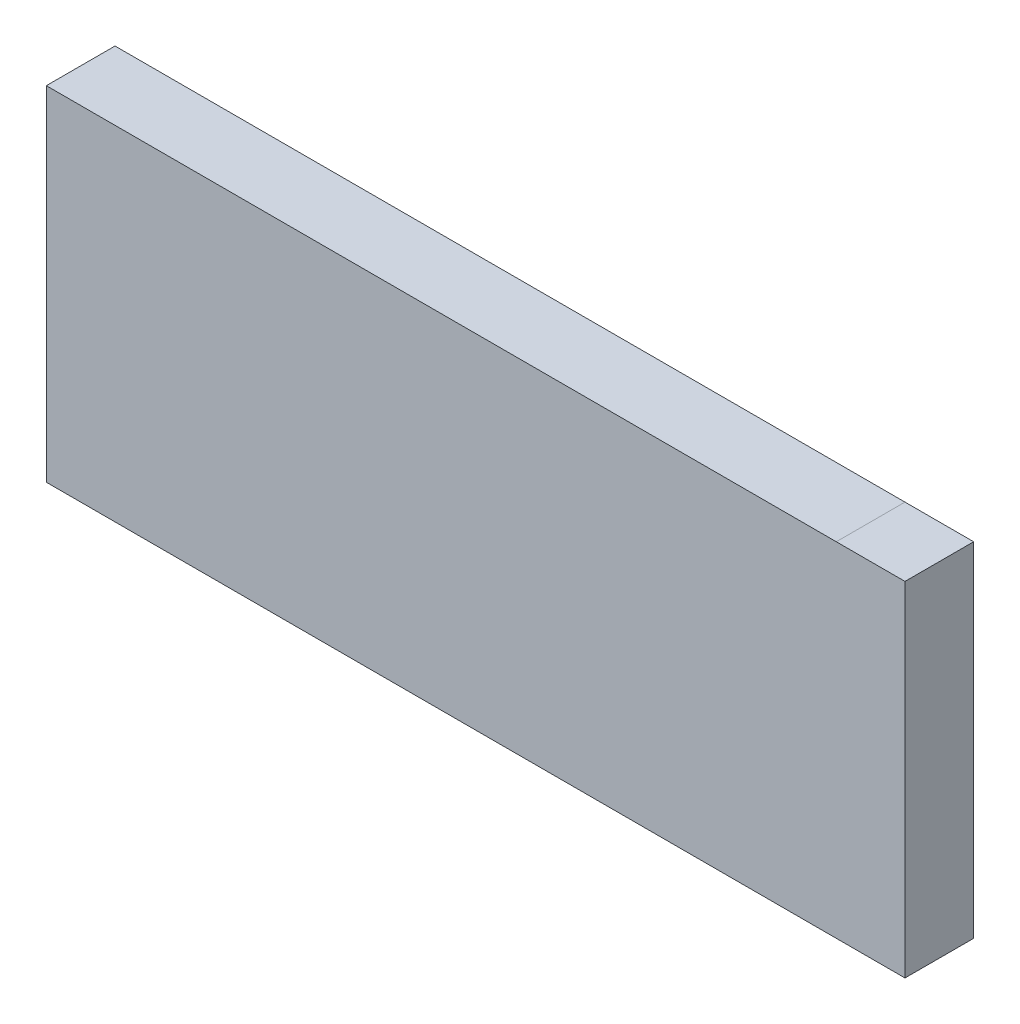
from build123d import *

# Parameters (mm, degrees)
SKIZZE1_W                       = 250
SKIZZE1_H                       = 100
AUFSATZ_LINEAR_AUSTRAGEN1_DEPTH = 20


with BuildPart() as part:
    # Skizze1 → Aufsatz-Linear austragen1 (new body)
    with BuildSketch(Plane.XY):
        with Locations((125, 0)):
            Rectangle(SKIZZE1_W, SKIZZE1_H)
    extrude(amount=AUFSATZ_LINEAR_AUSTRAGEN1_DEPTH)


solid = part.part
